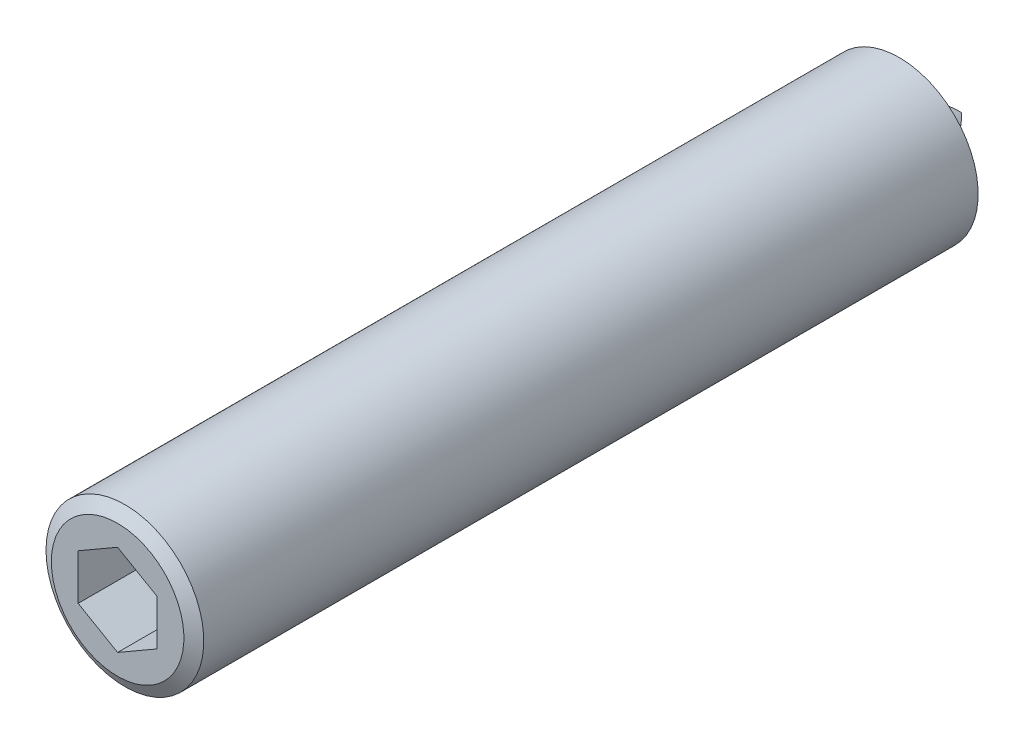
ISO-10303-21;
HEADER;
FILE_DESCRIPTION(('STEP AP214'),'2;1');
FILE_NAME('part.step','',(''),(''),'','','');
FILE_SCHEMA(('AUTOMOTIVE_DESIGN { 1 0 10303 214 1 1 1 1 }'));
ENDSEC;
DATA;
#1=APPLICATION_CONTEXT('core data for automotive mechanical design processes');
#2=APPLICATION_PROTOCOL_DEFINITION('international standard','automotive_design',2000,#1);
#3=PRODUCT_CONTEXT('',#1,'mechanical');
#4=PRODUCT('Part','Part','',(#3));
#5=PRODUCT_RELATED_PRODUCT_CATEGORY('part','',(#4));
#6=PRODUCT_DEFINITION_FORMATION('','',#4);
#7=PRODUCT_DEFINITION_CONTEXT('part definition',#1,'design');
#8=PRODUCT_DEFINITION('design','',#6,#7);
#9=PRODUCT_DEFINITION_SHAPE('','',#8);
#10=(LENGTH_UNIT() NAMED_UNIT(*) SI_UNIT(.MILLI.,.METRE.));
#11=(NAMED_UNIT(*) PLANE_ANGLE_UNIT() SI_UNIT($,.RADIAN.));
#12=(NAMED_UNIT(*) SI_UNIT($,.STERADIAN.) SOLID_ANGLE_UNIT());
#13=UNCERTAINTY_MEASURE_WITH_UNIT(LENGTH_MEASURE(1.E-05),#10,'distance_accuracy_value','');
#14=(GEOMETRIC_REPRESENTATION_CONTEXT(3) GLOBAL_UNCERTAINTY_ASSIGNED_CONTEXT((#13)) GLOBAL_UNIT_ASSIGNED_CONTEXT((#10,
#11,#12)) REPRESENTATION_CONTEXT('',''));
#15=CARTESIAN_POINT('',(0.,0.,0.));
#16=DIRECTION('',(0.,0.,1.));
#17=DIRECTION('',(1.,0.,0.));
#18=AXIS2_PLACEMENT_3D('',#15,#16,#17);
#19=CARTESIAN_POINT('',(0.,-5.,0.));
#20=DIRECTION('',(0.70710678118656,0.,0.707106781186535));
#21=DIRECTION('',(0.707106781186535,0.,-0.70710678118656));
#22=AXIS2_PLACEMENT_3D('',#19,#20,#21);
#23=PLANE('',#22);
#24=DIRECTION('',(0.577350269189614,-0.577350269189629,-0.577350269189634));
#25=VECTOR('',#24,1.);
#26=CARTESIAN_POINT('',(0.899999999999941,-3.20000000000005,-0.9));
#27=LINE('',#26,#25);
#28=CARTESIAN_POINT('',(-1.15,-1.15,1.15));
#29=VERTEX_POINT('',#28);
#30=CARTESIAN_POINT('',(0.,-2.3,0.));
#31=VERTEX_POINT('',#30);
#32=EDGE_CURVE('E300',#29,#31,#27,.T.);
#33=ORIENTED_EDGE('',*,*,#32,.T.);
#34=DIRECTION('',(-0.57735026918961,-0.577350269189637,0.57735026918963));
#35=VECTOR('',#34,1.);
#36=CARTESIAN_POINT('',(-0.90000000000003,-3.2,0.9));
#37=LINE('',#36,#35);
#38=CARTESIAN_POINT('',(-0.798717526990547,-3.09871752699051,0.798717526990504));
#39=VERTEX_POINT('',#38);
#40=EDGE_CURVE('E289',#31,#39,#37,.T.);
#41=ORIENTED_EDGE('',*,*,#40,.T.);
#42=CARTESIAN_POINT('',(0.,0.,0.));
#43=DIRECTION('',(0.70710678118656,0.,0.707106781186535));
#44=DIRECTION('',(-0.707106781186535,0.,0.70710678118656));
#45=AXIS2_PLACEMENT_3D('',#42,#43,#44);
#46=ELLIPSE('',#45,4.52548339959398,3.2);
#47=CARTESIAN_POINT('',(-1.15000000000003,-2.98621834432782,1.15));
#48=VERTEX_POINT('',#47);
#49=EDGE_CURVE('E367',#48,#39,#46,.T.);
#50=ORIENTED_EDGE('',*,*,#49,.F.);
#51=DIRECTION('',(0.,1.,0.));
#52=VECTOR('',#51,1.);
#53=CARTESIAN_POINT('',(-1.15000000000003,-5.,1.15));
#54=LINE('',#53,#52);
#55=EDGE_CURVE('E338',#48,#29,#54,.T.);
#56=ORIENTED_EDGE('',*,*,#55,.T.);
#57=EDGE_LOOP('',(#33,#41,#50,#56));
#58=FACE_BOUND('',#57,.T.);
#59=ADVANCED_FACE('F15',(#58),#23,.F.);
#60=CARTESIAN_POINT('',(-0.798717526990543,3.09871752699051,0.798717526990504));
#61=VERTEX_POINT('',#60);
#62=CARTESIAN_POINT('',(-1.15000000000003,2.98621834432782,1.15));
#63=VERTEX_POINT('',#62);
#64=EDGE_CURVE('E371',#61,#63,#46,.T.);
#65=ORIENTED_EDGE('',*,*,#64,.F.);
#66=DIRECTION('',(0.577350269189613,-0.577350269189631,-0.577350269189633));
#67=VECTOR('',#66,1.);
#68=CARTESIAN_POINT('',(2.43333333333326,-0.1333333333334,-2.4333333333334));
#69=LINE('',#68,#67);
#70=CARTESIAN_POINT('',(0.,2.30000000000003,0.));
#71=VERTEX_POINT('',#70);
#72=EDGE_CURVE('E282',#61,#71,#69,.T.);
#73=ORIENTED_EDGE('',*,*,#72,.T.);
#74=DIRECTION('',(-0.577350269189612,-0.577350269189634,0.577350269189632));
#75=VECTOR('',#74,1.);
#76=CARTESIAN_POINT('',(-2.43333333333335,-0.133333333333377,2.4333333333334));
#77=LINE('',#76,#75);
#78=CARTESIAN_POINT('',(-1.15000000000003,1.15,1.15));
#79=VERTEX_POINT('',#78);
#80=EDGE_CURVE('E269',#71,#79,#77,.T.);
#81=ORIENTED_EDGE('',*,*,#80,.T.);
#82=EDGE_CURVE('E344',#79,#63,#54,.T.);
#83=ORIENTED_EDGE('',*,*,#82,.T.);
#84=EDGE_LOOP('',(#65,#73,#81,#83));
#85=FACE_BOUND('',#84,.T.);
#86=ADVANCED_FACE('F531',(#85),#23,.F.);
#87=CARTESIAN_POINT('',(-1.15000000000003,-5.,1.15));
#88=DIRECTION('',(-0.707106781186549,0.,0.707106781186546));
#89=DIRECTION('',(0.707106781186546,0.,0.707106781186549));
#90=AXIS2_PLACEMENT_3D('',#87,#88,#89);
#91=PLANE('',#90);
#92=CARTESIAN_POINT('',(0.,0.,2.3));
#93=DIRECTION('',(-0.707106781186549,0.,0.707106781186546));
#94=DIRECTION('',(0.707106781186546,0.,0.707106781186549));
#95=AXIS2_PLACEMENT_3D('',#92,#93,#94);
#96=ELLIPSE('',#95,4.52548339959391,3.2);
#97=CARTESIAN_POINT('',(-2.26274169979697,-2.26274169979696,0.0372583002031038));
#98=VERTEX_POINT('',#97);
#99=EDGE_CURVE('E372',#98,#48,#96,.T.);
#100=ORIENTED_EDGE('',*,*,#99,.F.);
#101=DIRECTION('',(0.577350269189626,0.577350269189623,0.577350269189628));
#102=VECTOR('',#101,1.);
#103=CARTESIAN_POINT('',(-2.43333333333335,-2.43333333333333,-0.133333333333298));
#104=LINE('',#103,#102);
#105=EDGE_CURVE('E308',#98,#29,#104,.T.);
#106=ORIENTED_EDGE('',*,*,#105,.T.);
#107=ORIENTED_EDGE('',*,*,#55,.F.);
#108=EDGE_LOOP('',(#100,#106,#107));
#109=FACE_BOUND('',#108,.T.);
#110=ADVANCED_FACE('F506',(#109),#91,.F.);
#111=ORIENTED_EDGE('',*,*,#82,.F.);
#112=DIRECTION('',(-0.577350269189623,0.577350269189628,-0.577350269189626));
#113=VECTOR('',#112,1.);
#114=CARTESIAN_POINT('',(0.89999999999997,-0.900000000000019,3.2));
#115=LINE('',#114,#113);
#116=CARTESIAN_POINT('',(-2.26274169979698,2.26274169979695,0.0372583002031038));
#117=VERTEX_POINT('',#116);
#118=EDGE_CURVE('E277',#79,#117,#115,.T.);
#119=ORIENTED_EDGE('',*,*,#118,.T.);
#120=EDGE_CURVE('E375',#63,#117,#96,.T.);
#121=ORIENTED_EDGE('',*,*,#120,.F.);
#122=EDGE_LOOP('',(#111,#119,#121));
#123=FACE_BOUND('',#122,.T.);
#124=ADVANCED_FACE('F578',(#123),#91,.F.);
#125=CARTESIAN_POINT('',(1.14999999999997,-5.,1.15));
#126=DIRECTION('',(0.707106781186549,0.,0.707106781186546));
#127=DIRECTION('',(0.707106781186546,0.,-0.707106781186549));
#128=AXIS2_PLACEMENT_3D('',#125,#126,#127);
#129=PLANE('',#128);
#130=DIRECTION('',(0.,1.,0.));
#131=VECTOR('',#130,1.);
#132=CARTESIAN_POINT('',(1.14999999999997,-5.,1.15));
#133=LINE('',#132,#131);
#134=CARTESIAN_POINT('',(1.14999999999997,-2.98621834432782,1.15));
#135=VERTEX_POINT('',#134);
#136=CARTESIAN_POINT('',(1.15000000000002,-1.15,1.15));
#137=VERTEX_POINT('',#136);
#138=EDGE_CURVE('E345',#135,#137,#133,.T.);
#139=ORIENTED_EDGE('',*,*,#138,.T.);
#140=DIRECTION('',(0.577350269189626,-0.577350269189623,-0.577350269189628));
#141=VECTOR('',#140,1.);
#142=CARTESIAN_POINT('',(2.43333333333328,-2.43333333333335,-0.133333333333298));
#143=LINE('',#142,#141);
#144=CARTESIAN_POINT('',(2.2627416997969,-2.26274169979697,0.0372583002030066));
#145=VERTEX_POINT('',#144);
#146=EDGE_CURVE('E296',#137,#145,#143,.T.);
#147=ORIENTED_EDGE('',*,*,#146,.T.);
#148=CARTESIAN_POINT('',(0.,0.,2.3));
#149=DIRECTION('',(0.707106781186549,0.,0.707106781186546));
#150=DIRECTION('',(-0.707106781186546,0.,0.707106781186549));
#151=AXIS2_PLACEMENT_3D('',#148,#149,#150);
#152=ELLIPSE('',#151,4.52548339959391,3.2);
#153=EDGE_CURVE('E357',#135,#145,#152,.T.);
#154=ORIENTED_EDGE('',*,*,#153,.F.);
#155=EDGE_LOOP('',(#139,#147,#154));
#156=FACE_BOUND('',#155,.T.);
#157=ADVANCED_FACE('F482',(#156),#129,.F.);
#158=CARTESIAN_POINT('',(2.2627416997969,2.26274169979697,0.0372583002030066));
#159=VERTEX_POINT('',#158);
#160=CARTESIAN_POINT('',(1.14999999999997,2.98621834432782,1.15));
#161=VERTEX_POINT('',#160);
#162=EDGE_CURVE('E363',#159,#161,#152,.T.);
#163=ORIENTED_EDGE('',*,*,#162,.F.);
#164=DIRECTION('',(-0.577350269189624,-0.577350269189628,0.577350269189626));
#165=VECTOR('',#164,1.);
#166=CARTESIAN_POINT('',(-0.900000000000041,-0.9,3.2));
#167=LINE('',#166,#165);
#168=CARTESIAN_POINT('',(1.15,1.15,1.15));
#169=VERTEX_POINT('',#168);
#170=EDGE_CURVE('E265',#159,#169,#167,.T.);
#171=ORIENTED_EDGE('',*,*,#170,.T.);
#172=EDGE_CURVE('E350',#169,#161,#133,.T.);
#173=ORIENTED_EDGE('',*,*,#172,.T.);
#174=EDGE_LOOP('',(#163,#171,#173));
#175=FACE_BOUND('',#174,.T.);
#176=ADVANCED_FACE('F462',(#175),#129,.F.);
#177=CARTESIAN_POINT('',(0.,-5.,0.));
#178=DIRECTION('',(-0.707106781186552,0.,0.707106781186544));
#179=DIRECTION('',(0.707106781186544,0.,0.707106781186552));
#180=AXIS2_PLACEMENT_3D('',#177,#178,#179);
#181=PLANE('',#180);
#182=CARTESIAN_POINT('',(0.,0.,0.));
#183=DIRECTION('',(-0.707106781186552,0.,0.707106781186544));
#184=DIRECTION('',(0.707106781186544,0.,0.707106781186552));
#185=AXIS2_PLACEMENT_3D('',#182,#183,#184);
#186=ELLIPSE('',#185,4.52548339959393,3.2);
#187=CARTESIAN_POINT('',(0.798717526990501,-3.0987175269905,0.798717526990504));
#188=VERTEX_POINT('',#187);
#189=EDGE_CURVE('E354',#188,#135,#186,.T.);
#190=ORIENTED_EDGE('',*,*,#189,.F.);
#191=DIRECTION('',(-0.577350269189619,0.577350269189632,-0.577350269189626));
#192=VECTOR('',#191,1.);
#193=CARTESIAN_POINT('',(0.899999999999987,-3.2,0.9));
#194=LINE('',#193,#192);
#195=EDGE_CURVE('E400',#188,#31,#194,.T.);
#196=ORIENTED_EDGE('',*,*,#195,.T.);
#197=DIRECTION('',(0.577350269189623,0.577350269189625,0.57735026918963));
#198=VECTOR('',#197,1.);
#199=CARTESIAN_POINT('',(-0.9,-3.2,-0.9));
#200=LINE('',#199,#198);
#201=EDGE_CURVE('E396',#31,#137,#200,.T.);
#202=ORIENTED_EDGE('',*,*,#201,.T.);
#203=ORIENTED_EDGE('',*,*,#138,.F.);
#204=EDGE_LOOP('',(#190,#196,#202,#203));
#205=FACE_BOUND('',#204,.T.);
#206=ADVANCED_FACE('F487',(#205),#181,.F.);
#207=DIRECTION('',(-0.577350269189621,0.577350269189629,-0.577350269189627));
#208=VECTOR('',#207,1.);
#209=CARTESIAN_POINT('',(2.43333333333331,-0.133333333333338,2.4333333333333));
#210=LINE('',#209,#208);
#211=EDGE_CURVE('E384',#169,#71,#210,.T.);
#212=ORIENTED_EDGE('',*,*,#211,.T.);
#213=DIRECTION('',(0.577350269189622,0.577350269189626,0.577350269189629));
#214=VECTOR('',#213,1.);
#215=CARTESIAN_POINT('',(-2.43333333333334,-0.133333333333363,-2.4333333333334));
#216=LINE('',#215,#214);
#217=CARTESIAN_POINT('',(0.798717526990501,3.0987175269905,0.798717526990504));
#218=VERTEX_POINT('',#217);
#219=EDGE_CURVE('E388',#71,#218,#216,.T.);
#220=ORIENTED_EDGE('',*,*,#219,.T.);
#221=EDGE_CURVE('E358',#161,#218,#186,.T.);
#222=ORIENTED_EDGE('',*,*,#221,.F.);
#223=ORIENTED_EDGE('',*,*,#172,.F.);
#224=EDGE_LOOP('',(#212,#220,#222,#223));
#225=FACE_BOUND('',#224,.T.);
#226=ADVANCED_FACE('F433',(#225),#181,.F.);
#227=CARTESIAN_POINT('',(0.,0.,46.27));
#228=DIRECTION('',(0.,0.,1.));
#229=DIRECTION('',(1.,0.,0.));
#230=AXIS2_PLACEMENT_3D('',#227,#228,#229);
#231=CYLINDRICAL_SURFACE('',#230,3.2);
#232=CARTESIAN_POINT('',(0.,0.,1.27));
#233=DIRECTION('',(0.,0.,1.));
#234=DIRECTION('',(1.,0.,0.));
#235=AXIS2_PLACEMENT_3D('',#232,#233,#234);
#236=CIRCLE('',#235,3.2);
#237=CARTESIAN_POINT('',(3.19999999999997,0.,1.27));
#238=VERTEX_POINT('',#237);
#239=EDGE_CURVE('E342',#238,#238,#236,.T.);
#240=ORIENTED_EDGE('',*,*,#239,.F.);
#241=EDGE_LOOP('',(#240));
#242=FACE_BOUND('',#241,.T.);
#243=CARTESIAN_POINT('',(0.,0.,-2.3));
#244=DIRECTION('',(0.707106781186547,0.,0.707106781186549));
#245=DIRECTION('',(-0.707106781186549,0.,0.707106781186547));
#246=AXIS2_PLACEMENT_3D('',#243,#244,#245);
#247=ELLIPSE('',#246,4.5254833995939,3.2);
#248=CARTESIAN_POINT('',(-3.09871752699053,0.79871752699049,0.798717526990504));
#249=VERTEX_POINT('',#248);
#250=CARTESIAN_POINT('',(-3.09871752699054,-0.798717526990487,0.798717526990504));
#251=VERTEX_POINT('',#250);
#252=EDGE_CURVE('E376',#249,#251,#247,.T.);
#253=ORIENTED_EDGE('',*,*,#252,.T.);
#254=CARTESIAN_POINT('',(0.,0.,0.));
#255=DIRECTION('',(0.,0.707106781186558,0.707106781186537));
#256=DIRECTION('',(0.,-0.707106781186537,0.707106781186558));
#257=AXIS2_PLACEMENT_3D('',#254,#255,#256);
#258=ELLIPSE('',#257,4.52548339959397,3.2);
#259=CARTESIAN_POINT('',(-2.98621834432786,-1.15,1.15));
#260=VERTEX_POINT('',#259);
#261=EDGE_CURVE('E330',#251,#260,#258,.T.);
#262=ORIENTED_EDGE('',*,*,#261,.T.);
#263=CARTESIAN_POINT('',(0.,0.,2.3));
#264=DIRECTION('',(0.,-0.707106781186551,0.707106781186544));
#265=DIRECTION('',(0.,0.707106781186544,0.707106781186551));
#266=AXIS2_PLACEMENT_3D('',#263,#264,#265);
#267=ELLIPSE('',#266,4.52548339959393,3.2);
#268=EDGE_CURVE('E309',#260,#98,#267,.T.);
#269=ORIENTED_EDGE('',*,*,#268,.T.);
#270=ORIENTED_EDGE('',*,*,#99,.T.);
#271=ORIENTED_EDGE('',*,*,#49,.T.);
#272=CARTESIAN_POINT('',(0.,0.,-2.3));
#273=DIRECTION('',(0.,0.707106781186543,0.707106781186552));
#274=DIRECTION('',(0.,-0.707106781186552,0.707106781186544));
#275=AXIS2_PLACEMENT_3D('',#272,#273,#274);
#276=ELLIPSE('',#275,4.52548339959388,3.2);
#277=EDGE_CURVE('E293',#39,#188,#276,.T.);
#278=ORIENTED_EDGE('',*,*,#277,.T.);
#279=ORIENTED_EDGE('',*,*,#189,.T.);
#280=ORIENTED_EDGE('',*,*,#153,.T.);
#281=CARTESIAN_POINT('',(2.9862183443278,-1.15,1.15));
#282=VERTEX_POINT('',#281);
#283=EDGE_CURVE('E304',#145,#282,#267,.T.);
#284=ORIENTED_EDGE('',*,*,#283,.T.);
#285=CARTESIAN_POINT('',(3.09871752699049,-0.798717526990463,0.798717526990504));
#286=VERTEX_POINT('',#285);
#287=EDGE_CURVE('E325',#282,#286,#258,.T.);
#288=ORIENTED_EDGE('',*,*,#287,.T.);
#289=CARTESIAN_POINT('',(0.,0.,-2.3));
#290=DIRECTION('',(-0.707106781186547,0.,0.707106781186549));
#291=DIRECTION('',(0.707106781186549,0.,0.707106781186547));
#292=AXIS2_PLACEMENT_3D('',#289,#290,#291);
#293=ELLIPSE('',#292,4.5254833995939,3.2);
#294=CARTESIAN_POINT('',(3.09871752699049,0.79871752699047,0.798717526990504));
#295=VERTEX_POINT('',#294);
#296=EDGE_CURVE('E362',#286,#295,#293,.T.);
#297=ORIENTED_EDGE('',*,*,#296,.T.);
#298=CARTESIAN_POINT('',(0.,0.,0.));
#299=DIRECTION('',(0.,-0.707106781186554,0.707106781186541));
#300=DIRECTION('',(0.,0.707106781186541,0.707106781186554));
#301=AXIS2_PLACEMENT_3D('',#298,#299,#300);
#302=ELLIPSE('',#301,4.52548339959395,3.2);
#303=CARTESIAN_POINT('',(2.9862183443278,1.15,1.15));
#304=VERTEX_POINT('',#303);
#305=EDGE_CURVE('E254',#295,#304,#302,.T.);
#306=ORIENTED_EDGE('',*,*,#305,.T.);
#307=CARTESIAN_POINT('',(0.,0.,2.3));
#308=DIRECTION('',(0.,0.707106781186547,0.707106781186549));
#309=DIRECTION('',(0.,-0.707106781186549,0.707106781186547));
#310=AXIS2_PLACEMENT_3D('',#307,#308,#309);
#311=ELLIPSE('',#310,4.5254833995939,3.2);
#312=EDGE_CURVE('E273',#304,#159,#311,.T.);
#313=ORIENTED_EDGE('',*,*,#312,.T.);
#314=ORIENTED_EDGE('',*,*,#162,.T.);
#315=ORIENTED_EDGE('',*,*,#221,.T.);
#316=CARTESIAN_POINT('',(0.,0.,-2.3));
#317=DIRECTION('',(0.,-0.707106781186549,0.707106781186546));
#318=DIRECTION('',(0.,0.707106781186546,0.707106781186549));
#319=AXIS2_PLACEMENT_3D('',#316,#317,#318);
#320=ELLIPSE('',#319,4.52548339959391,3.2);
#321=EDGE_CURVE('E286',#218,#61,#320,.T.);
#322=ORIENTED_EDGE('',*,*,#321,.T.);
#323=ORIENTED_EDGE('',*,*,#64,.T.);
#324=ORIENTED_EDGE('',*,*,#120,.T.);
#325=CARTESIAN_POINT('',(-2.98621834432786,1.15,1.15));
#326=VERTEX_POINT('',#325);
#327=EDGE_CURVE('E278',#117,#326,#311,.T.);
#328=ORIENTED_EDGE('',*,*,#327,.T.);
#329=EDGE_CURVE('E258',#326,#249,#302,.T.);
#330=ORIENTED_EDGE('',*,*,#329,.T.);
#331=EDGE_LOOP('',(#253,#262,#269,#270,#271,#278,#279,#280,#284,#288,#297,#306,#313,#314,#315,
#322,#323,#324,#328,#330));
#332=FACE_BOUND('',#331,.T.);
#333=ADVANCED_FACE('F427',(#242,#332),#231,.T.);
#334=CARTESIAN_POINT('',(5.,0.,1.27));
#335=DIRECTION('',(0.,0.,-1.));
#336=DIRECTION('',(-1.,0.,0.));
#337=AXIS2_PLACEMENT_3D('',#334,#335,#336);
#338=PLANE('',#337);
#339=CARTESIAN_POINT('',(0.,0.,1.27));
#340=DIRECTION('',(0.,0.,-1.));
#341=DIRECTION('',(-1.,0.,0.));
#342=AXIS2_PLACEMENT_3D('',#339,#340,#341);
#343=CIRCLE('',#342,4.2);
#344=CARTESIAN_POINT('',(-4.20000000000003,0.,1.27));
#345=VERTEX_POINT('',#344);
#346=EDGE_CURVE('E404',#345,#345,#343,.T.);
#347=ORIENTED_EDGE('',*,*,#346,.T.);
#348=EDGE_LOOP('',(#347));
#349=FACE_BOUND('',#348,.T.);
#350=ORIENTED_EDGE('',*,*,#239,.T.);
#351=EDGE_LOOP('',(#350));
#352=FACE_BOUND('',#351,.T.);
#353=ADVANCED_FACE('F423',(#349,#352),#338,.T.);
#354=CARTESIAN_POINT('',(-2.30000000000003,-5.,0.));
#355=DIRECTION('',(0.707106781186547,0.,0.707106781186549));
#356=DIRECTION('',(0.707106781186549,0.,-0.707106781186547));
#357=AXIS2_PLACEMENT_3D('',#354,#355,#356);
#358=PLANE('',#357);
#359=DIRECTION('',(0.57735026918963,-0.577350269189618,-0.577350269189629));
#360=VECTOR('',#359,1.);
#361=CARTESIAN_POINT('',(-0.633333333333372,-1.66666666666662,-1.6666666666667));
#362=LINE('',#361,#360);
#363=CARTESIAN_POINT('',(-2.30000000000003,0.,0.));
#364=VERTEX_POINT('',#363);
#365=EDGE_CURVE('E261',#249,#364,#362,.T.);
#366=ORIENTED_EDGE('',*,*,#365,.T.);
#367=DIRECTION('',(-0.577350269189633,-0.577350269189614,0.577350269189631));
#368=VECTOR('',#367,1.);
#369=CARTESIAN_POINT('',(-3.96666666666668,-1.6666666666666,1.6666666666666));
#370=LINE('',#369,#368);
#371=EDGE_CURVE('E334',#364,#251,#370,.T.);
#372=ORIENTED_EDGE('',*,*,#371,.T.);
#373=ORIENTED_EDGE('',*,*,#252,.F.);
#374=EDGE_LOOP('',(#366,#372,#373));
#375=FACE_BOUND('',#374,.T.);
#376=ADVANCED_FACE('F426',(#375),#358,.F.);
#377=CARTESIAN_POINT('',(2.29999999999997,-5.,0.));
#378=DIRECTION('',(-0.707106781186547,0.,0.707106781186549));
#379=DIRECTION('',(0.707106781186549,0.,0.707106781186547));
#380=AXIS2_PLACEMENT_3D('',#377,#378,#379);
#381=PLANE('',#380);
#382=ORIENTED_EDGE('',*,*,#296,.F.);
#383=DIRECTION('',(-0.577350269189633,0.577350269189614,-0.577350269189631));
#384=VECTOR('',#383,1.);
#385=CARTESIAN_POINT('',(3.96666666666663,-1.66666666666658,1.6666666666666));
#386=LINE('',#385,#384);
#387=CARTESIAN_POINT('',(2.29999999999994,0.,0.));
#388=VERTEX_POINT('',#387);
#389=EDGE_CURVE('E317',#286,#388,#386,.T.);
#390=ORIENTED_EDGE('',*,*,#389,.T.);
#391=DIRECTION('',(0.57735026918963,0.577350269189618,0.577350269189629));
#392=VECTOR('',#391,1.);
#393=CARTESIAN_POINT('',(0.633333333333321,-1.66666666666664,-1.6666666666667));
#394=LINE('',#393,#392);
#395=EDGE_CURVE('E246',#388,#295,#394,.T.);
#396=ORIENTED_EDGE('',*,*,#395,.T.);
#397=EDGE_LOOP('',(#382,#390,#396));
#398=FACE_BOUND('',#397,.T.);
#399=ADVANCED_FACE('F472',(#398),#381,.F.);
#400=CARTESIAN_POINT('',(5.,0.,0.));
#401=DIRECTION('',(0.,-0.707106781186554,0.707106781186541));
#402=DIRECTION('',(0.,0.707106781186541,0.707106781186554));
#403=AXIS2_PLACEMENT_3D('',#400,#401,#402);
#404=PLANE('',#403);
#405=DIRECTION('',(-1.,0.,0.));
#406=VECTOR('',#405,1.);
#407=CARTESIAN_POINT('',(5.,1.15,1.15));
#408=LINE('',#407,#406);
#409=EDGE_CURVE('E241',#169,#79,#408,.T.);
#410=ORIENTED_EDGE('',*,*,#409,.F.);
#411=DIRECTION('',(0.577350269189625,0.577350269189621,0.577350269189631));
#412=VECTOR('',#411,1.);
#413=CARTESIAN_POINT('',(-1.66666666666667,-1.66666666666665,-1.6666666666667));
#414=LINE('',#413,#412);
#415=CARTESIAN_POINT('',(0.,0.,0.));
#416=VERTEX_POINT('',#415);
#417=EDGE_CURVE('E380',#416,#169,#414,.T.);
#418=ORIENTED_EDGE('',*,*,#417,.F.);
#419=DIRECTION('',(0.577350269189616,-0.577350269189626,-0.577350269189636));
#420=VECTOR('',#419,1.);
#421=CARTESIAN_POINT('',(1.6666666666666,-1.66666666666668,-1.6666666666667));
#422=LINE('',#421,#420);
#423=EDGE_CURVE('E250',#79,#416,#422,.T.);
#424=ORIENTED_EDGE('',*,*,#423,.F.);
#425=EDGE_LOOP('',(#410,#418,#424));
#426=FACE_BOUND('',#425,.T.);
#427=ADVANCED_FACE('F519',(#426),#404,.F.);
#428=CARTESIAN_POINT('',(5.,1.15,1.15));
#429=DIRECTION('',(0.,0.707106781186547,0.707106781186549));
#430=DIRECTION('',(0.,0.707106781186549,-0.707106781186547));
#431=AXIS2_PLACEMENT_3D('',#428,#429,#430);
#432=PLANE('',#431);
#433=ORIENTED_EDGE('',*,*,#211,.F.);
#434=ORIENTED_EDGE('',*,*,#409,.T.);
#435=ORIENTED_EDGE('',*,*,#80,.F.);
#436=EDGE_LOOP('',(#433,#434,#435));
#437=FACE_BOUND('',#436,.T.);
#438=ADVANCED_FACE('F565',(#437),#432,.F.);
#439=CARTESIAN_POINT('',(5.,2.3,0.));
#440=DIRECTION('',(0.,-0.707106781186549,0.707106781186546));
#441=DIRECTION('',(0.,0.707106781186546,0.707106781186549));
#442=AXIS2_PLACEMENT_3D('',#439,#440,#441);
#443=PLANE('',#442);
#444=ORIENTED_EDGE('',*,*,#321,.F.);
#445=ORIENTED_EDGE('',*,*,#219,.F.);
#446=ORIENTED_EDGE('',*,*,#72,.F.);
#447=EDGE_LOOP('',(#444,#445,#446));
#448=FACE_BOUND('',#447,.T.);
#449=ADVANCED_FACE('F561',(#448),#443,.F.);
#450=CARTESIAN_POINT('',(5.,-2.3,0.));
#451=DIRECTION('',(0.,0.707106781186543,0.707106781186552));
#452=DIRECTION('',(0.,0.707106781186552,-0.707106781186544));
#453=AXIS2_PLACEMENT_3D('',#450,#451,#452);
#454=PLANE('',#453);
#455=ORIENTED_EDGE('',*,*,#277,.F.);
#456=ORIENTED_EDGE('',*,*,#40,.F.);
#457=ORIENTED_EDGE('',*,*,#195,.F.);
#458=EDGE_LOOP('',(#455,#456,#457));
#459=FACE_BOUND('',#458,.T.);
#460=ADVANCED_FACE('F558',(#459),#454,.F.);
#461=CARTESIAN_POINT('',(5.,-1.15,1.15));
#462=DIRECTION('',(0.,-0.707106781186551,0.707106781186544));
#463=DIRECTION('',(0.,0.707106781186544,0.707106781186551));
#464=AXIS2_PLACEMENT_3D('',#461,#462,#463);
#465=PLANE('',#464);
#466=DIRECTION('',(-1.,0.,0.));
#467=VECTOR('',#466,1.);
#468=CARTESIAN_POINT('',(5.,-1.15,1.15));
#469=LINE('',#468,#467);
#470=EDGE_CURVE('E235',#137,#29,#469,.T.);
#471=ORIENTED_EDGE('',*,*,#470,.F.);
#472=ORIENTED_EDGE('',*,*,#201,.F.);
#473=ORIENTED_EDGE('',*,*,#32,.F.);
#474=EDGE_LOOP('',(#471,#472,#473));
#475=FACE_BOUND('',#474,.T.);
#476=ADVANCED_FACE('F491',(#475),#465,.F.);
#477=CARTESIAN_POINT('',(5.,0.,0.));
#478=DIRECTION('',(0.,0.707106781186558,0.707106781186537));
#479=DIRECTION('',(0.,0.707106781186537,-0.707106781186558));
#480=AXIS2_PLACEMENT_3D('',#477,#478,#479);
#481=PLANE('',#480);
#482=DIRECTION('',(-0.577350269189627,0.577350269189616,-0.577350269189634));
#483=VECTOR('',#482,1.);
#484=CARTESIAN_POINT('',(1.66666666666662,-1.6666666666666,1.6666666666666));
#485=LINE('',#484,#483);
#486=EDGE_CURVE('E392',#137,#416,#485,.T.);
#487=ORIENTED_EDGE('',*,*,#486,.F.);
#488=ORIENTED_EDGE('',*,*,#470,.T.);
#489=DIRECTION('',(-0.577350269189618,-0.577350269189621,0.577350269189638));
#490=VECTOR('',#489,1.);
#491=CARTESIAN_POINT('',(-1.66666666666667,-1.66666666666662,1.6666666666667));
#492=LINE('',#491,#490);
#493=EDGE_CURVE('E321',#416,#29,#492,.T.);
#494=ORIENTED_EDGE('',*,*,#493,.F.);
#495=EDGE_LOOP('',(#487,#488,#494));
#496=FACE_BOUND('',#495,.T.);
#497=ADVANCED_FACE('F517',(#496),#481,.F.);
#498=ORIENTED_EDGE('',*,*,#395,.F.);
#499=DIRECTION('',(0.577350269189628,-0.57735026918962,-0.57735026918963));
#500=VECTOR('',#499,1.);
#501=CARTESIAN_POINT('',(3.2,-0.899999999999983,-0.9));
#502=LINE('',#501,#500);
#503=EDGE_CURVE('E242',#169,#388,#502,.T.);
#504=ORIENTED_EDGE('',*,*,#503,.F.);
#505=EDGE_CURVE('E236',#304,#169,#408,.T.);
#506=ORIENTED_EDGE('',*,*,#505,.F.);
#507=ORIENTED_EDGE('',*,*,#305,.F.);
#508=EDGE_LOOP('',(#498,#504,#506,#507));
#509=FACE_BOUND('',#508,.T.);
#510=ADVANCED_FACE('F470',(#509),#404,.F.);
#511=ORIENTED_EDGE('',*,*,#505,.T.);
#512=ORIENTED_EDGE('',*,*,#170,.F.);
#513=ORIENTED_EDGE('',*,*,#312,.F.);
#514=EDGE_LOOP('',(#511,#512,#513));
#515=FACE_BOUND('',#514,.T.);
#516=ADVANCED_FACE('F465',(#515),#432,.F.);
#517=ORIENTED_EDGE('',*,*,#146,.F.);
#518=EDGE_CURVE('E237',#282,#137,#469,.T.);
#519=ORIENTED_EDGE('',*,*,#518,.F.);
#520=ORIENTED_EDGE('',*,*,#283,.F.);
#521=EDGE_LOOP('',(#517,#519,#520));
#522=FACE_BOUND('',#521,.T.);
#523=ADVANCED_FACE('F479',(#522),#465,.F.);
#524=ORIENTED_EDGE('',*,*,#518,.T.);
#525=DIRECTION('',(-0.57735026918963,-0.577350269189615,0.577350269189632));
#526=VECTOR('',#525,1.);
#527=CARTESIAN_POINT('',(-0.13333333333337,-2.43333333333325,2.4333333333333));
#528=LINE('',#527,#526);
#529=EDGE_CURVE('E313',#388,#137,#528,.T.);
#530=ORIENTED_EDGE('',*,*,#529,.F.);
#531=ORIENTED_EDGE('',*,*,#389,.F.);
#532=ORIENTED_EDGE('',*,*,#287,.F.);
#533=EDGE_LOOP('',(#524,#530,#531,#532));
#534=FACE_BOUND('',#533,.T.);
#535=ADVANCED_FACE('F474',(#534),#481,.F.);
#536=EDGE_CURVE('E219',#79,#326,#408,.T.);
#537=ORIENTED_EDGE('',*,*,#536,.F.);
#538=DIRECTION('',(0.577350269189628,0.57735026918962,0.57735026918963));
#539=VECTOR('',#538,1.);
#540=CARTESIAN_POINT('',(-3.2,-0.899999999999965,-0.9));
#541=LINE('',#540,#539);
#542=EDGE_CURVE('E39',#364,#79,#541,.T.);
#543=ORIENTED_EDGE('',*,*,#542,.F.);
#544=ORIENTED_EDGE('',*,*,#365,.F.);
#545=ORIENTED_EDGE('',*,*,#329,.F.);
#546=EDGE_LOOP('',(#537,#543,#544,#545));
#547=FACE_BOUND('',#546,.T.);
#548=ADVANCED_FACE('F570',(#547),#404,.F.);
#549=ORIENTED_EDGE('',*,*,#118,.F.);
#550=ORIENTED_EDGE('',*,*,#536,.T.);
#551=ORIENTED_EDGE('',*,*,#327,.F.);
#552=EDGE_LOOP('',(#549,#550,#551));
#553=FACE_BOUND('',#552,.T.);
#554=ADVANCED_FACE('F567',(#553),#432,.F.);
#555=ORIENTED_EDGE('',*,*,#371,.F.);
#556=DIRECTION('',(-0.57735026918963,0.577350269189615,-0.577350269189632));
#557=VECTOR('',#556,1.);
#558=CARTESIAN_POINT('',(0.133333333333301,-2.43333333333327,2.4333333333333));
#559=LINE('',#558,#557);
#560=EDGE_CURVE('E329',#29,#364,#559,.T.);
#561=ORIENTED_EDGE('',*,*,#560,.F.);
#562=EDGE_CURVE('E231',#29,#260,#469,.T.);
#563=ORIENTED_EDGE('',*,*,#562,.T.);
#564=ORIENTED_EDGE('',*,*,#261,.F.);
#565=EDGE_LOOP('',(#555,#561,#563,#564));
#566=FACE_BOUND('',#565,.T.);
#567=ADVANCED_FACE('F443',(#566),#481,.F.);
#568=ORIENTED_EDGE('',*,*,#562,.F.);
#569=ORIENTED_EDGE('',*,*,#105,.F.);
#570=ORIENTED_EDGE('',*,*,#268,.F.);
#571=EDGE_LOOP('',(#568,#569,#570));
#572=FACE_BOUND('',#571,.T.);
#573=ADVANCED_FACE('F555',(#572),#465,.F.);
#574=EDGE_CURVE('E343',#29,#79,#54,.T.);
#575=ORIENTED_EDGE('',*,*,#574,.F.);
#576=ORIENTED_EDGE('',*,*,#560,.T.);
#577=ORIENTED_EDGE('',*,*,#542,.T.);
#578=EDGE_LOOP('',(#575,#576,#577));
#579=FACE_BOUND('',#578,.T.);
#580=ADVANCED_FACE('F511',(#579),#91,.F.);
#581=ORIENTED_EDGE('',*,*,#423,.T.);
#582=ORIENTED_EDGE('',*,*,#493,.T.);
#583=ORIENTED_EDGE('',*,*,#574,.T.);
#584=EDGE_LOOP('',(#581,#582,#583));
#585=FACE_BOUND('',#584,.T.);
#586=ADVANCED_FACE('F514',(#585),#23,.F.);
#587=EDGE_CURVE('E349',#137,#169,#133,.T.);
#588=ORIENTED_EDGE('',*,*,#587,.F.);
#589=ORIENTED_EDGE('',*,*,#486,.T.);
#590=ORIENTED_EDGE('',*,*,#417,.T.);
#591=EDGE_LOOP('',(#588,#589,#590));
#592=FACE_BOUND('',#591,.T.);
#593=ADVANCED_FACE('F521',(#592),#181,.F.);
#594=ORIENTED_EDGE('',*,*,#503,.T.);
#595=ORIENTED_EDGE('',*,*,#529,.T.);
#596=ORIENTED_EDGE('',*,*,#587,.T.);
#597=EDGE_LOOP('',(#594,#595,#596));
#598=FACE_BOUND('',#597,.T.);
#599=ADVANCED_FACE('F456',(#598),#129,.F.);
#600=CARTESIAN_POINT('',(0.,0.,46.27));
#601=DIRECTION('',(0.,0.,1.));
#602=DIRECTION('',(1.,0.,0.));
#603=AXIS2_PLACEMENT_3D('',#600,#601,#602);
#604=CYLINDRICAL_SURFACE('',#603,5.);
#605=CARTESIAN_POINT('',(0.,0.,1.7318802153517));
#606=DIRECTION('',(0.,0.,-1.));
#607=DIRECTION('',(-1.,0.,0.));
#608=AXIS2_PLACEMENT_3D('',#605,#606,#607);
#609=CIRCLE('',#608,5.);
#610=CARTESIAN_POINT('',(-5.00000000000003,0.,1.7318802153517));
#611=VERTEX_POINT('',#610);
#612=EDGE_CURVE('E24',#611,#611,#609,.F.);
#613=ORIENTED_EDGE('',*,*,#612,.T.);
#614=EDGE_LOOP('',(#613));
#615=FACE_BOUND('',#614,.T.);
#616=CARTESIAN_POINT('',(0.,0.,50.8081197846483));
#617=DIRECTION('',(0.,0.,-1.));
#618=DIRECTION('',(-1.,0.,0.));
#619=AXIS2_PLACEMENT_3D('',#616,#617,#618);
#620=CIRCLE('',#619,5.);
#621=CARTESIAN_POINT('',(-5.00000000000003,0.,50.8081197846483));
#622=VERTEX_POINT('',#621);
#623=EDGE_CURVE('E408',#622,#622,#620,.T.);
#624=ORIENTED_EDGE('',*,*,#623,.T.);
#625=EDGE_LOOP('',(#624));
#626=FACE_BOUND('',#625,.T.);
#627=ADVANCED_FACE('F415',(#615,#626),#604,.T.);
#628=CARTESIAN_POINT('',(0.,0.,51.27));
#629=DIRECTION('',(0.,0.,-1.));
#630=DIRECTION('',(-1.,0.,0.));
#631=AXIS2_PLACEMENT_3D('',#628,#629,#630);
#632=PLANE('',#631);
#633=CARTESIAN_POINT('',(0.,0.,51.27));
#634=DIRECTION('',(0.,0.,-1.));
#635=DIRECTION('',(-1.,0.,0.));
#636=AXIS2_PLACEMENT_3D('',#633,#634,#635);
#637=CIRCLE('',#636,4.2);
#638=CARTESIAN_POINT('',(-4.20000000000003,0.,51.27));
#639=VERTEX_POINT('',#638);
#640=EDGE_CURVE('E9',#639,#639,#637,.F.);
#641=ORIENTED_EDGE('',*,*,#640,.T.);
#642=EDGE_LOOP('',(#641));
#643=FACE_BOUND('',#642,.T.);
#644=DIRECTION('',(-0.866025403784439,-0.5,0.));
#645=VECTOR('',#644,1.);
#646=CARTESIAN_POINT('',(0.,2.88675134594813,51.27));
#647=LINE('',#646,#645);
#648=CARTESIAN_POINT('',(0.,2.88675134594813,51.27));
#649=VERTEX_POINT('',#648);
#650=CARTESIAN_POINT('',(-2.5,1.44337567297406,51.27));
#651=VERTEX_POINT('',#650);
#652=EDGE_CURVE('E202',#649,#651,#647,.T.);
#653=ORIENTED_EDGE('',*,*,#652,.F.);
#654=DIRECTION('',(-0.866025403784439,0.5,0.));
#655=VECTOR('',#654,1.);
#656=CARTESIAN_POINT('',(2.49999999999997,1.44337567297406,51.27));
#657=LINE('',#656,#655);
#658=CARTESIAN_POINT('',(2.49999999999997,1.44337567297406,51.27));
#659=VERTEX_POINT('',#658);
#660=EDGE_CURVE('E31',#659,#649,#657,.T.);
#661=ORIENTED_EDGE('',*,*,#660,.F.);
#662=DIRECTION('',(0.,1.,0.));
#663=VECTOR('',#662,1.);
#664=CARTESIAN_POINT('',(2.49999999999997,-1.44337567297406,51.27));
#665=LINE('',#664,#663);
#666=CARTESIAN_POINT('',(2.49999999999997,-1.44337567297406,51.27));
#667=VERTEX_POINT('',#666);
#668=EDGE_CURVE('E181',#667,#659,#665,.T.);
#669=ORIENTED_EDGE('',*,*,#668,.F.);
#670=DIRECTION('',(0.866025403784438,0.5,0.));
#671=VECTOR('',#670,1.);
#672=CARTESIAN_POINT('',(0.,-2.88675134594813,51.27));
#673=LINE('',#672,#671);
#674=CARTESIAN_POINT('',(0.,-2.88675134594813,51.27));
#675=VERTEX_POINT('',#674);
#676=EDGE_CURVE('E186',#675,#667,#673,.T.);
#677=ORIENTED_EDGE('',*,*,#676,.F.);
#678=DIRECTION('',(0.866025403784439,-0.5,0.));
#679=VECTOR('',#678,1.);
#680=CARTESIAN_POINT('',(-2.5,-1.44337567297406,51.27));
#681=LINE('',#680,#679);
#682=CARTESIAN_POINT('',(-2.5,-1.44337567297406,51.27));
#683=VERTEX_POINT('',#682);
#684=EDGE_CURVE('E209',#683,#675,#681,.T.);
#685=ORIENTED_EDGE('',*,*,#684,.F.);
#686=DIRECTION('',(0.,-1.,0.));
#687=VECTOR('',#686,1.);
#688=CARTESIAN_POINT('',(-2.5,1.44337567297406,51.27));
#689=LINE('',#688,#687);
#690=EDGE_CURVE('E205',#651,#683,#689,.T.);
#691=ORIENTED_EDGE('',*,*,#690,.F.);
#692=EDGE_LOOP('',(#653,#661,#669,#677,#685,#691));
#693=FACE_BOUND('',#692,.T.);
#694=ADVANCED_FACE('F541',(#643,#693),#632,.F.);
#695=CARTESIAN_POINT('',(2.49999999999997,1.44337567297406,47.27));
#696=DIRECTION('',(0.5,0.866025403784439,0.));
#697=DIRECTION('',(0.866025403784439,-0.5,0.));
#698=AXIS2_PLACEMENT_3D('',#695,#696,#697);
#699=PLANE('',#698);
#700=ORIENTED_EDGE('',*,*,#660,.T.);
#701=DIRECTION('',(0.,0.,1.));
#702=VECTOR('',#701,1.);
#703=CARTESIAN_POINT('',(0.,2.88675134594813,47.27));
#704=LINE('',#703,#702);
#705=CARTESIAN_POINT('',(0.,2.88675134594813,47.27));
#706=VERTEX_POINT('',#705);
#707=EDGE_CURVE('E155',#706,#649,#704,.T.);
#708=ORIENTED_EDGE('',*,*,#707,.F.);
#709=DIRECTION('',(-0.866025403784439,0.5,0.));
#710=VECTOR('',#709,1.);
#711=CARTESIAN_POINT('',(2.49999999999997,1.44337567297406,47.27));
#712=LINE('',#711,#710);
#713=CARTESIAN_POINT('',(2.49999999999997,1.44337567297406,47.27));
#714=VERTEX_POINT('',#713);
#715=EDGE_CURVE('E159',#714,#706,#712,.T.);
#716=ORIENTED_EDGE('',*,*,#715,.F.);
#717=DIRECTION('',(0.,0.,1.));
#718=VECTOR('',#717,1.);
#719=CARTESIAN_POINT('',(2.49999999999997,1.44337567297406,47.27));
#720=LINE('',#719,#718);
#721=EDGE_CURVE('E216',#714,#659,#720,.T.);
#722=ORIENTED_EDGE('',*,*,#721,.T.);
#723=EDGE_LOOP('',(#700,#708,#716,#722));
#724=FACE_BOUND('',#723,.T.);
#725=ADVANCED_FACE('F157',(#724),#699,.F.);
#726=CARTESIAN_POINT('',(2.49999999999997,-1.44337567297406,47.27));
#727=DIRECTION('',(1.,0.,0.));
#728=DIRECTION('',(0.,0.,-1.));
#729=AXIS2_PLACEMENT_3D('',#726,#727,#728);
#730=PLANE('',#729);
#731=ORIENTED_EDGE('',*,*,#668,.T.);
#732=ORIENTED_EDGE('',*,*,#721,.F.);
#733=DIRECTION('',(0.,1.,0.));
#734=VECTOR('',#733,1.);
#735=CARTESIAN_POINT('',(2.49999999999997,-1.44337567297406,47.27));
#736=LINE('',#735,#734);
#737=CARTESIAN_POINT('',(2.49999999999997,-1.44337567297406,47.27));
#738=VERTEX_POINT('',#737);
#739=EDGE_CURVE('E166',#738,#714,#736,.T.);
#740=ORIENTED_EDGE('',*,*,#739,.F.);
#741=DIRECTION('',(0.,0.,1.));
#742=VECTOR('',#741,1.);
#743=CARTESIAN_POINT('',(2.49999999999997,-1.44337567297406,47.27));
#744=LINE('',#743,#742);
#745=EDGE_CURVE('E220',#738,#667,#744,.T.);
#746=ORIENTED_EDGE('',*,*,#745,.T.);
#747=EDGE_LOOP('',(#731,#732,#740,#746));
#748=FACE_BOUND('',#747,.T.);
#749=ADVANCED_FACE('F550',(#748),#730,.F.);
#750=CARTESIAN_POINT('',(0.,-2.88675134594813,47.27));
#751=DIRECTION('',(0.5,-0.866025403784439,0.));
#752=DIRECTION('',(-0.866025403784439,-0.5,0.));
#753=AXIS2_PLACEMENT_3D('',#750,#751,#752);
#754=PLANE('',#753);
#755=ORIENTED_EDGE('',*,*,#676,.T.);
#756=ORIENTED_EDGE('',*,*,#745,.F.);
#757=DIRECTION('',(0.866025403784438,0.5,0.));
#758=VECTOR('',#757,1.);
#759=CARTESIAN_POINT('',(0.,-2.88675134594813,47.27));
#760=LINE('',#759,#758);
#761=CARTESIAN_POINT('',(0.,-2.88675134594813,47.27));
#762=VERTEX_POINT('',#761);
#763=EDGE_CURVE('E195',#762,#738,#760,.T.);
#764=ORIENTED_EDGE('',*,*,#763,.F.);
#765=DIRECTION('',(0.,0.,1.));
#766=VECTOR('',#765,1.);
#767=CARTESIAN_POINT('',(0.,-2.88675134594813,47.27));
#768=LINE('',#767,#766);
#769=EDGE_CURVE('E223',#762,#675,#768,.T.);
#770=ORIENTED_EDGE('',*,*,#769,.T.);
#771=EDGE_LOOP('',(#755,#756,#764,#770));
#772=FACE_BOUND('',#771,.T.);
#773=ADVANCED_FACE('F805',(#772),#754,.F.);
#774=CARTESIAN_POINT('',(-2.5,-1.44337567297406,47.27));
#775=DIRECTION('',(-0.5,-0.866025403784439,0.));
#776=DIRECTION('',(-0.866025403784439,0.5,0.));
#777=AXIS2_PLACEMENT_3D('',#774,#775,#776);
#778=PLANE('',#777);
#779=ORIENTED_EDGE('',*,*,#684,.T.);
#780=ORIENTED_EDGE('',*,*,#769,.F.);
#781=DIRECTION('',(0.866025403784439,-0.5,0.));
#782=VECTOR('',#781,1.);
#783=CARTESIAN_POINT('',(-2.5,-1.44337567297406,47.27));
#784=LINE('',#783,#782);
#785=CARTESIAN_POINT('',(-2.5,-1.44337567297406,47.27));
#786=VERTEX_POINT('',#785);
#787=EDGE_CURVE('E191',#786,#762,#784,.T.);
#788=ORIENTED_EDGE('',*,*,#787,.F.);
#789=DIRECTION('',(0.,0.,1.));
#790=VECTOR('',#789,1.);
#791=CARTESIAN_POINT('',(-2.5,-1.44337567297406,47.27));
#792=LINE('',#791,#790);
#793=EDGE_CURVE('E226',#786,#683,#792,.T.);
#794=ORIENTED_EDGE('',*,*,#793,.T.);
#795=EDGE_LOOP('',(#779,#780,#788,#794));
#796=FACE_BOUND('',#795,.T.);
#797=ADVANCED_FACE('F814',(#796),#778,.F.);
#798=CARTESIAN_POINT('',(-2.5,1.44337567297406,47.27));
#799=DIRECTION('',(-1.,0.,0.));
#800=DIRECTION('',(0.,0.,1.));
#801=AXIS2_PLACEMENT_3D('',#798,#799,#800);
#802=PLANE('',#801);
#803=ORIENTED_EDGE('',*,*,#690,.T.);
#804=ORIENTED_EDGE('',*,*,#793,.F.);
#805=DIRECTION('',(0.,-1.,0.));
#806=VECTOR('',#805,1.);
#807=CARTESIAN_POINT('',(-2.5,1.44337567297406,47.27));
#808=LINE('',#807,#806);
#809=CARTESIAN_POINT('',(-2.5,1.44337567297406,47.27));
#810=VERTEX_POINT('',#809);
#811=EDGE_CURVE('E175',#810,#786,#808,.T.);
#812=ORIENTED_EDGE('',*,*,#811,.F.);
#813=DIRECTION('',(0.,0.,1.));
#814=VECTOR('',#813,1.);
#815=CARTESIAN_POINT('',(-2.5,1.44337567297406,47.27));
#816=LINE('',#815,#814);
#817=EDGE_CURVE('E165',#810,#651,#816,.T.);
#818=ORIENTED_EDGE('',*,*,#817,.T.);
#819=EDGE_LOOP('',(#803,#804,#812,#818));
#820=FACE_BOUND('',#819,.T.);
#821=ADVANCED_FACE('F823',(#820),#802,.F.);
#822=CARTESIAN_POINT('',(0.,2.88675134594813,47.27));
#823=DIRECTION('',(-0.5,0.866025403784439,0.));
#824=DIRECTION('',(0.866025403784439,0.5,0.));
#825=AXIS2_PLACEMENT_3D('',#822,#823,#824);
#826=PLANE('',#825);
#827=ORIENTED_EDGE('',*,*,#652,.T.);
#828=ORIENTED_EDGE('',*,*,#817,.F.);
#829=DIRECTION('',(-0.866025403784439,-0.5,0.));
#830=VECTOR('',#829,1.);
#831=CARTESIAN_POINT('',(0.,2.88675134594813,47.27));
#832=LINE('',#831,#830);
#833=EDGE_CURVE('E169',#706,#810,#832,.T.);
#834=ORIENTED_EDGE('',*,*,#833,.F.);
#835=ORIENTED_EDGE('',*,*,#707,.T.);
#836=EDGE_LOOP('',(#827,#828,#834,#835));
#837=FACE_BOUND('',#836,.T.);
#838=ADVANCED_FACE('F170',(#837),#826,.F.);
#839=CARTESIAN_POINT('',(0.,2.88675134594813,47.27));
#840=DIRECTION('',(0.,0.,1.));
#841=DIRECTION('',(1.,0.,0.));
#842=AXIS2_PLACEMENT_3D('',#839,#840,#841);
#843=PLANE('',#842);
#844=ORIENTED_EDGE('',*,*,#715,.T.);
#845=ORIENTED_EDGE('',*,*,#833,.T.);
#846=ORIENTED_EDGE('',*,*,#811,.T.);
#847=ORIENTED_EDGE('',*,*,#787,.T.);
#848=ORIENTED_EDGE('',*,*,#763,.T.);
#849=ORIENTED_EDGE('',*,*,#739,.T.);
#850=EDGE_LOOP('',(#844,#845,#846,#847,#848,#849));
#851=FACE_BOUND('',#850,.T.);
#852=ADVANCED_FACE('F177',(#851),#843,.T.);
#853=CARTESIAN_POINT('',(0.,0.,1.27));
#854=DIRECTION('',(0.,0.,1.));
#855=DIRECTION('',(1.,0.,0.));
#856=AXIS2_PLACEMENT_3D('',#853,#854,#855);
#857=CONICAL_SURFACE('',#856,4.2,1.0471975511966);
#858=ORIENTED_EDGE('',*,*,#612,.F.);
#859=EDGE_LOOP('',(#858));
#860=FACE_BOUND('',#859,.T.);
#861=ORIENTED_EDGE('',*,*,#346,.F.);
#862=EDGE_LOOP('',(#861));
#863=FACE_BOUND('',#862,.T.);
#864=ADVANCED_FACE('F418',(#860,#863),#857,.T.);
#865=CARTESIAN_POINT('',(0.,0.,50.8081197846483));
#866=DIRECTION('',(0.,0.,-1.));
#867=DIRECTION('',(-1.,0.,0.));
#868=AXIS2_PLACEMENT_3D('',#865,#866,#867);
#869=CONICAL_SURFACE('',#868,5.,1.0471975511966);
#870=ORIENTED_EDGE('',*,*,#640,.F.);
#871=EDGE_LOOP('',(#870));
#872=FACE_BOUND('',#871,.T.);
#873=ORIENTED_EDGE('',*,*,#623,.F.);
#874=EDGE_LOOP('',(#873));
#875=FACE_BOUND('',#874,.T.);
#876=ADVANCED_FACE('F17',(#872,#875),#869,.T.);
#877=CLOSED_SHELL('',(#59,#86,#110,#124,#157,#176,#206,#226,#333,#353,#376,#399,#427,#438,#449,
#460,#476,#497,#510,#516,#523,#535,#548,#554,#567,#573,#580,#586,#593,#599,#627,#694,#725,#749,
#773,#797,#821,#838,#852,#864,#876));
#878=MANIFOLD_SOLID_BREP('B1',#877);
#879=ADVANCED_BREP_SHAPE_REPRESENTATION('',(#18,#878),#14);
#880=SHAPE_DEFINITION_REPRESENTATION(#9,#879);
ENDSEC;
END-ISO-10303-21;
